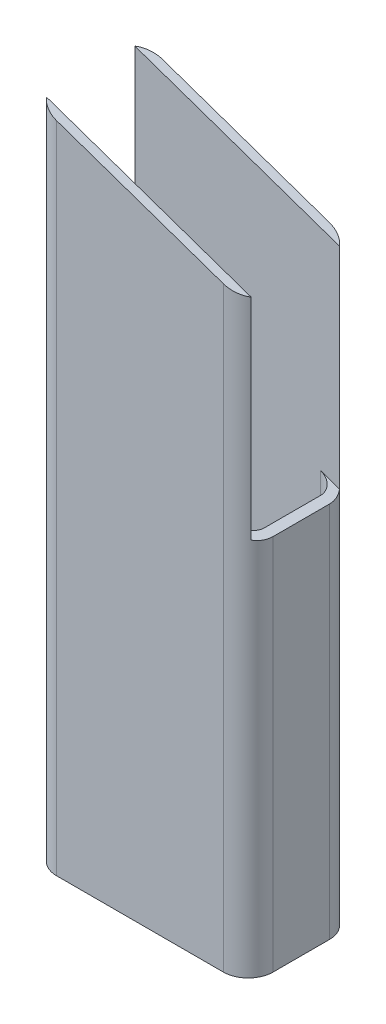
from build123d import *

# Parameters (mm, degrees)
SALIENTE_EXTRUIR1_DEPTH = 300
CORTAR_EXTRUIR7_DEPTH   = 330.878765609
CORTAR_EXTRUIR8_DEPTH   = 40


with BuildPart() as part:
    # Croquis2 → Saliente-Extruir1 (new, symmetric)
    with BuildSketch(Plane(origin=(0, 0, 0), x_dir=(1, 0, 0), z_dir=(0, 1, 0))):
        with BuildLine():
            ThreePointArc((98, -25.5), (91.409902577, -41.409902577), (75.5, -48))
            Line((75.5, -48), (-75.5, -48))
            ThreePointArc((-75.5, -48), (-91.409902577, -41.409902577), (-98, -25.5))
            Line((-98, -25.5), (-98, 25.5))
            ThreePointArc((-98, 25.5), (-91.409902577, 41.409902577), (-75.5, 48))
            Line((-75.5, 48), (75.5, 48))
            ThreePointArc((75.5, 48), (91.409902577, 41.409902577), (98, 25.5))
            Line((98, 25.5), (98, -25.5))
        make_face()
        with BuildLine():
            Line((90, 25.5), (90, -25.5))
            ThreePointArc((90, -25.5), (85.753048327, -35.753048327), (75.5, -40))
            Line((75.5, -40), (-75.5, -40))
            ThreePointArc((-75.5, -40), (-85.753048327, -35.753048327), (-90, -25.5))
            Line((-90, -25.5), (-90, 25.5))
            ThreePointArc((-90, 25.5), (-85.753048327, 35.753048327), (-75.5, 40))
            Line((-75.5, 40), (75.5, 40))
            ThreePointArc((75.5, 40), (85.753048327, 35.753048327), (90, 25.5))
        make_face(mode=Mode.SUBTRACT)
    extrude(amount=SALIENTE_EXTRUIR1_DEPTH, both=True)

    # Croquis12 → Cortar-Extruir7 (cut, through all)
    with BuildSketch(Plane.XY.offset(48)):
        Polygon((-98, 300), (98, 300), (98, 232.053333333), align=None)
    extrude(amount=-CORTAR_EXTRUIR7_DEPTH, mode=Mode.SUBTRACT)

    # Croquis13 → Cortar-Extruir8 (cut, symmetric)
    with BuildSketch(Plane.XY):
        Polygon((-98, 300), (-98, 109.49), (98, 41.543333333), (98, 232.053333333), align=None)
    extrude(amount=CORTAR_EXTRUIR8_DEPTH, both=True, mode=Mode.SUBTRACT)


solid = part.part
